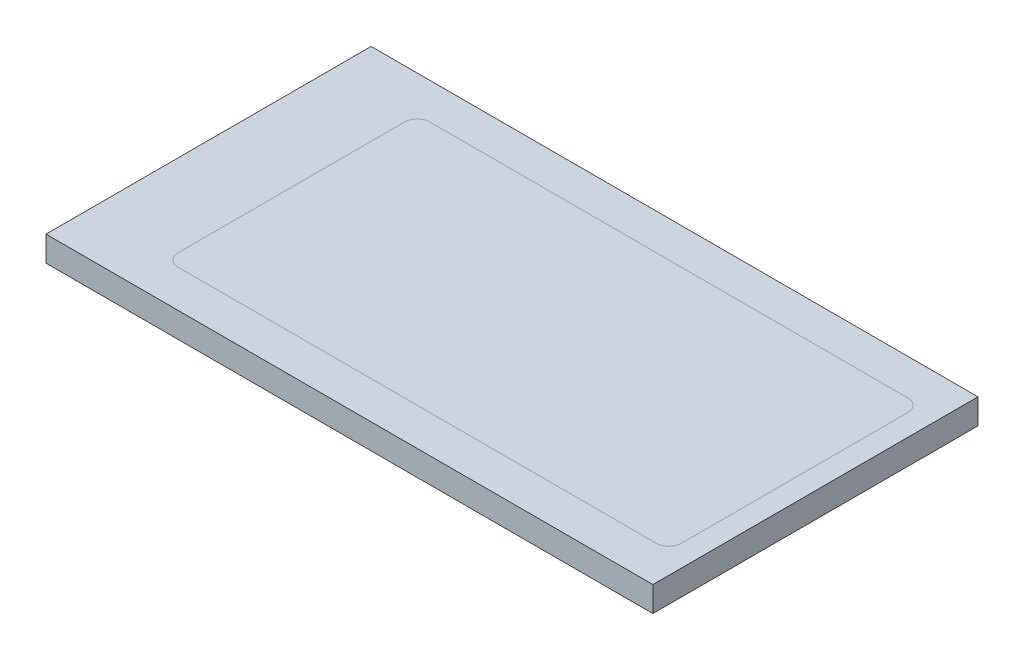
ISO-10303-21;
HEADER;
FILE_DESCRIPTION(('STEP AP214'),'2;1');
FILE_NAME('part.step','',(''),(''),'','','');
FILE_SCHEMA(('AUTOMOTIVE_DESIGN { 1 0 10303 214 1 1 1 1 }'));
ENDSEC;
DATA;
#1=APPLICATION_CONTEXT('core data for automotive mechanical design processes');
#2=APPLICATION_PROTOCOL_DEFINITION('international standard','automotive_design',2000,#1);
#3=PRODUCT_CONTEXT('',#1,'mechanical');
#4=PRODUCT('Part','Part','',(#3));
#5=PRODUCT_RELATED_PRODUCT_CATEGORY('part','',(#4));
#6=PRODUCT_DEFINITION_FORMATION('','',#4);
#7=PRODUCT_DEFINITION_CONTEXT('part definition',#1,'design');
#8=PRODUCT_DEFINITION('design','',#6,#7);
#9=PRODUCT_DEFINITION_SHAPE('','',#8);
#10=(LENGTH_UNIT() NAMED_UNIT(*) SI_UNIT(.MILLI.,.METRE.));
#11=(NAMED_UNIT(*) PLANE_ANGLE_UNIT() SI_UNIT($,.RADIAN.));
#12=(NAMED_UNIT(*) SI_UNIT($,.STERADIAN.) SOLID_ANGLE_UNIT());
#13=UNCERTAINTY_MEASURE_WITH_UNIT(LENGTH_MEASURE(1.E-05),#10,'distance_accuracy_value','');
#14=(GEOMETRIC_REPRESENTATION_CONTEXT(3) GLOBAL_UNCERTAINTY_ASSIGNED_CONTEXT((#13)) GLOBAL_UNIT_ASSIGNED_CONTEXT((#10,
#11,#12)) REPRESENTATION_CONTEXT('',''));
#15=CARTESIAN_POINT('',(0.,0.,0.));
#16=DIRECTION('',(0.,0.,1.));
#17=DIRECTION('',(1.,0.,0.));
#18=AXIS2_PLACEMENT_3D('',#15,#16,#17);
#19=CARTESIAN_POINT('',(0.,-100.,0.));
#20=DIRECTION('',(0.,1.,0.));
#21=DIRECTION('',(0.,0.,1.));
#22=AXIS2_PLACEMENT_3D('',#19,#20,#21);
#23=PLANE('',#22);
#24=DIRECTION('',(0.,0.,-1.));
#25=VECTOR('',#24,1.);
#26=CARTESIAN_POINT('',(577.109459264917,-100.,-513.152738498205));
#27=LINE('',#26,#25);
#28=CARTESIAN_POINT('',(577.109459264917,-100.,-383.952040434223));
#29=VERTEX_POINT('',#28);
#30=CARTESIAN_POINT('',(577.109459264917,-100.,-513.152738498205));
#31=VERTEX_POINT('',#30);
#32=EDGE_CURVE('E123',#29,#31,#27,.T.);
#33=ORIENTED_EDGE('',*,*,#32,.F.);
#34=DIRECTION('',(1.,0.,0.));
#35=VECTOR('',#34,1.);
#36=CARTESIAN_POINT('',(335.935434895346,-100.,-383.952040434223));
#37=LINE('',#36,#35);
#38=CARTESIAN_POINT('',(335.935434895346,-100.,-383.952040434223));
#39=VERTEX_POINT('',#38);
#40=EDGE_CURVE('E136',#39,#29,#37,.T.);
#41=ORIENTED_EDGE('',*,*,#40,.F.);
#42=DIRECTION('',(0.,0.,1.));
#43=VECTOR('',#42,1.);
#44=CARTESIAN_POINT('',(335.935434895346,-100.,-513.152738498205));
#45=LINE('',#44,#43);
#46=CARTESIAN_POINT('',(335.935434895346,-100.,-513.152738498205));
#47=VERTEX_POINT('',#46);
#48=EDGE_CURVE('E125',#47,#39,#45,.T.);
#49=ORIENTED_EDGE('',*,*,#48,.F.);
#50=DIRECTION('',(-1.,0.,0.));
#51=VECTOR('',#50,1.);
#52=CARTESIAN_POINT('',(335.935434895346,-100.,-513.152738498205));
#53=LINE('',#52,#51);
#54=EDGE_CURVE('E114',#31,#47,#53,.T.);
#55=ORIENTED_EDGE('',*,*,#54,.F.);
#56=EDGE_LOOP('',(#33,#41,#49,#55));
#57=FACE_BOUND('',#56,.T.);
#58=ADVANCED_FACE('F40',(#57),#23,.F.);
#59=CARTESIAN_POINT('',(335.935434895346,-50.,-383.952040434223));
#60=DIRECTION('',(0.,0.,-1.));
#61=DIRECTION('',(-1.,0.,0.));
#62=AXIS2_PLACEMENT_3D('',#59,#60,#61);
#63=PLANE('',#62);
#64=DIRECTION('',(0.,-1.,0.));
#65=VECTOR('',#64,1.);
#66=CARTESIAN_POINT('',(577.109459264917,-50.,-383.952040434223));
#67=LINE('',#66,#65);
#68=CARTESIAN_POINT('',(577.109459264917,-90.,-383.952040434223));
#69=VERTEX_POINT('',#68);
#70=EDGE_CURVE('E128',#69,#29,#67,.T.);
#71=ORIENTED_EDGE('',*,*,#70,.F.);
#72=DIRECTION('',(-1.,0.,0.));
#73=VECTOR('',#72,1.);
#74=CARTESIAN_POINT('',(335.935434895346,-90.,-383.952040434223));
#75=LINE('',#74,#73);
#76=CARTESIAN_POINT('',(335.935434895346,-90.,-383.952040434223));
#77=VERTEX_POINT('',#76);
#78=EDGE_CURVE('E44',#69,#77,#75,.T.);
#79=ORIENTED_EDGE('',*,*,#78,.T.);
#80=DIRECTION('',(0.,-1.,0.));
#81=VECTOR('',#80,1.);
#82=CARTESIAN_POINT('',(335.935434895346,-50.,-383.952040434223));
#83=LINE('',#82,#81);
#84=EDGE_CURVE('E139',#77,#39,#83,.T.);
#85=ORIENTED_EDGE('',*,*,#84,.T.);
#86=ORIENTED_EDGE('',*,*,#40,.T.);
#87=EDGE_LOOP('',(#71,#79,#85,#86));
#88=FACE_BOUND('',#87,.T.);
#89=ADVANCED_FACE('F206',(#88),#63,.F.);
#90=CARTESIAN_POINT('',(335.935434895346,-50.,-513.152738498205));
#91=DIRECTION('',(1.,0.,0.));
#92=DIRECTION('',(0.,0.,-1.));
#93=AXIS2_PLACEMENT_3D('',#90,#91,#92);
#94=PLANE('',#93);
#95=ORIENTED_EDGE('',*,*,#84,.F.);
#96=DIRECTION('',(0.,0.,-1.));
#97=VECTOR('',#96,1.);
#98=CARTESIAN_POINT('',(335.935434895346,-90.,-513.152738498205));
#99=LINE('',#98,#97);
#100=CARTESIAN_POINT('',(335.935434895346,-90.,-513.152738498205));
#101=VERTEX_POINT('',#100);
#102=EDGE_CURVE('E145',#77,#101,#99,.T.);
#103=ORIENTED_EDGE('',*,*,#102,.T.);
#104=DIRECTION('',(0.,-1.,0.));
#105=VECTOR('',#104,1.);
#106=CARTESIAN_POINT('',(335.935434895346,-50.,-513.152738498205));
#107=LINE('',#106,#105);
#108=EDGE_CURVE('E119',#101,#47,#107,.T.);
#109=ORIENTED_EDGE('',*,*,#108,.T.);
#110=ORIENTED_EDGE('',*,*,#48,.T.);
#111=EDGE_LOOP('',(#95,#103,#109,#110));
#112=FACE_BOUND('',#111,.T.);
#113=ADVANCED_FACE('F144',(#112),#94,.F.);
#114=CARTESIAN_POINT('',(335.935434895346,-50.,-513.152738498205));
#115=DIRECTION('',(0.,0.,1.));
#116=DIRECTION('',(1.,0.,0.));
#117=AXIS2_PLACEMENT_3D('',#114,#115,#116);
#118=PLANE('',#117);
#119=ORIENTED_EDGE('',*,*,#108,.F.);
#120=DIRECTION('',(1.,0.,0.));
#121=VECTOR('',#120,1.);
#122=CARTESIAN_POINT('',(335.935434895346,-90.,-513.152738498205));
#123=LINE('',#122,#121);
#124=CARTESIAN_POINT('',(577.109459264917,-90.,-513.152738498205));
#125=VERTEX_POINT('',#124);
#126=EDGE_CURVE('E60',#101,#125,#123,.T.);
#127=ORIENTED_EDGE('',*,*,#126,.T.);
#128=DIRECTION('',(0.,-1.,0.));
#129=VECTOR('',#128,1.);
#130=CARTESIAN_POINT('',(577.109459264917,-50.,-513.152738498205));
#131=LINE('',#130,#129);
#132=EDGE_CURVE('E111',#125,#31,#131,.T.);
#133=ORIENTED_EDGE('',*,*,#132,.T.);
#134=ORIENTED_EDGE('',*,*,#54,.T.);
#135=EDGE_LOOP('',(#119,#127,#133,#134));
#136=FACE_BOUND('',#135,.T.);
#137=ADVANCED_FACE('F113',(#136),#118,.F.);
#138=CARTESIAN_POINT('',(577.109459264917,-50.,-513.152738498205));
#139=DIRECTION('',(-1.,0.,0.));
#140=DIRECTION('',(0.,0.,1.));
#141=AXIS2_PLACEMENT_3D('',#138,#139,#140);
#142=PLANE('',#141);
#143=ORIENTED_EDGE('',*,*,#132,.F.);
#144=DIRECTION('',(0.,0.,1.));
#145=VECTOR('',#144,1.);
#146=CARTESIAN_POINT('',(577.109459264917,-90.,-513.152738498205));
#147=LINE('',#146,#145);
#148=EDGE_CURVE('E132',#125,#69,#147,.T.);
#149=ORIENTED_EDGE('',*,*,#148,.T.);
#150=ORIENTED_EDGE('',*,*,#70,.T.);
#151=ORIENTED_EDGE('',*,*,#32,.T.);
#152=EDGE_LOOP('',(#143,#149,#150,#151));
#153=FACE_BOUND('',#152,.T.);
#154=ADVANCED_FACE('F42',(#153),#142,.F.);
#155=CARTESIAN_POINT('',(373.58203197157,-90.,-398.813583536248));
#156=DIRECTION('',(0.,-1.,0.));
#157=DIRECTION('',(1.,0.,0.));
#158=AXIS2_PLACEMENT_3D('',#155,#156,#157);
#159=PLANE('',#158);
#160=DIRECTION('',(-1.,0.,0.));
#161=VECTOR('',#160,1.);
#162=CARTESIAN_POINT('',(563.582222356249,-90.,-498.813583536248));
#163=LINE('',#162,#161);
#164=CARTESIAN_POINT('',(563.582222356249,-90.,-498.813583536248));
#165=VERTEX_POINT('',#164);
#166=CARTESIAN_POINT('',(373.58203197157,-90.,-498.813583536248));
#167=VERTEX_POINT('',#166);
#168=EDGE_CURVE('E199',#165,#167,#163,.T.);
#169=ORIENTED_EDGE('',*,*,#168,.F.);
#170=CARTESIAN_POINT('',(568.58203197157,-90.,-493.813773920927));
#171=CARTESIAN_POINT('',(568.582031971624,-90.,-494.303840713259));
#172=CARTESIAN_POINT('',(568.485900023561,-90.,-494.787990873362));
#173=CARTESIAN_POINT('',(568.389645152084,-90.,-495.272760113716));
#174=CARTESIAN_POINT('',(568.201313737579,-90.,-495.72747973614));
#175=CARTESIAN_POINT('',(568.014381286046,-90.,-496.178821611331));
#176=CARTESIAN_POINT('',(567.74099144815,-90.,-496.588649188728));
#177=CARTESIAN_POINT('',(567.466590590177,-90.,-496.999992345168));
#178=CARTESIAN_POINT('',(567.118583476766,-90.,-497.348257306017));
#179=CARTESIAN_POINT('',(566.773102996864,-90.,-497.693993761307));
#180=CARTESIAN_POINT('',(566.36353488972,-90.,-497.968240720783));
#181=CARTESIAN_POINT('',(565.953400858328,-90.,-498.24286662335));
#182=CARTESIAN_POINT('',(565.499456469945,-90.,-498.431401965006));
#183=CARTESIAN_POINT('',(565.046571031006,-90.,-498.619497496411));
#184=CARTESIAN_POINT('',(564.561628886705,-90.,-498.716417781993));
#185=CARTESIAN_POINT('',(564.075458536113,-90.,-498.813583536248));
#186=CARTESIAN_POINT('',(563.582222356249,-90.,-498.813583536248));
#187=B_SPLINE_CURVE_WITH_KNOTS('',2,(#170,#171,#172,#173,#174,#175,#176,#177,#178,#179,#180,
#181,#182,#183,#184,#185,#186),.UNSPECIFIED.,.F.,.F.,(3,2,2,2,2,2,2,2,3),(0.,0.125,0.25,0.375,
0.5,0.625,0.75,0.875,1.),.UNSPECIFIED.);
#188=CARTESIAN_POINT('',(568.58203197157,-90.,-493.813773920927));
#189=VERTEX_POINT('',#188);
#190=EDGE_CURVE('E11',#189,#165,#187,.T.);
#191=ORIENTED_EDGE('',*,*,#190,.F.);
#192=DIRECTION('',(0.,0.,-1.));
#193=VECTOR('',#192,1.);
#194=CARTESIAN_POINT('',(568.58203197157,-90.,-403.813393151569));
#195=LINE('',#194,#193);
#196=CARTESIAN_POINT('',(568.58203197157,-90.,-403.813393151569));
#197=VERTEX_POINT('',#196);
#198=EDGE_CURVE('E51',#197,#189,#195,.T.);
#199=ORIENTED_EDGE('',*,*,#198,.F.);
#200=CARTESIAN_POINT('',(563.582222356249,-90.,-398.813583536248));
#201=CARTESIAN_POINT('',(564.072289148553,-90.,-398.813583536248));
#202=CARTESIAN_POINT('',(564.556439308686,-90.,-398.909715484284));
#203=CARTESIAN_POINT('',(565.04120854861,-90.,-399.005970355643));
#204=CARTESIAN_POINT('',(565.495928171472,-90.,-399.194301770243));
#205=CARTESIAN_POINT('',(565.947270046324,-90.,-399.381234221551));
#206=CARTESIAN_POINT('',(566.357097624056,-90.,-399.65462405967));
#207=CARTESIAN_POINT('',(566.768440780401,-90.,-399.929024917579));
#208=CARTESIAN_POINT('',(567.116705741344,-90.,-400.277032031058));
#209=CARTESIAN_POINT('',(567.462442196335,-90.,-400.622512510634));
#210=CARTESIAN_POINT('',(567.73668915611,-90.,-401.032080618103));
#211=CARTESIAN_POINT('',(568.011315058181,-90.,-401.442214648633));
#212=CARTESIAN_POINT('',(568.199850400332,-90.,-401.896159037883));
#213=CARTESIAN_POINT('',(568.387945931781,-90.,-402.349044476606));
#214=CARTESIAN_POINT('',(568.484866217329,-90.,-402.833986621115));
#215=CARTESIAN_POINT('',(568.582031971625,-90.,-403.320156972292));
#216=CARTESIAN_POINT('',(568.58203197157,-90.,-403.813393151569));
#217=B_SPLINE_CURVE_WITH_KNOTS('',2,(#200,#201,#202,#203,#204,#205,#206,#207,#208,#209,#210,
#211,#212,#213,#214,#215,#216),.UNSPECIFIED.,.F.,.F.,(3,2,2,2,2,2,2,2,3),(0.,0.125,0.25,0.375,
0.5,0.625,0.75,0.875,1.),.UNSPECIFIED.);
#218=CARTESIAN_POINT('',(563.582222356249,-90.,-398.813583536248));
#219=VERTEX_POINT('',#218);
#220=EDGE_CURVE('E175',#219,#197,#217,.T.);
#221=ORIENTED_EDGE('',*,*,#220,.F.);
#222=DIRECTION('',(1.,0.,0.));
#223=VECTOR('',#222,1.);
#224=CARTESIAN_POINT('',(373.58203197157,-90.,-398.813583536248));
#225=LINE('',#224,#223);
#226=CARTESIAN_POINT('',(373.58203197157,-90.,-398.813583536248));
#227=VERTEX_POINT('',#226);
#228=EDGE_CURVE('E178',#227,#219,#225,.T.);
#229=ORIENTED_EDGE('',*,*,#228,.F.);
#230=CARTESIAN_POINT('',(368.58203197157,-90.,-403.813773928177));
#231=CARTESIAN_POINT('',(368.582031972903,-90.,-403.323684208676));
#232=CARTESIAN_POINT('',(368.678169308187,-90.,-402.83950449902));
#233=CARTESIAN_POINT('',(368.774428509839,-90.,-402.354711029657));
#234=CARTESIAN_POINT('',(368.962766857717,-90.,-401.899963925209));
#235=CARTESIAN_POINT('',(369.149705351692,-90.,-401.448596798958));
#236=CARTESIAN_POINT('',(369.423102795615,-90.,-401.038741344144));
#237=CARTESIAN_POINT('',(369.697511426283,-90.,-400.627369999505));
#238=CARTESIAN_POINT('',(370.045526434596,-90.,-400.279077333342));
#239=CARTESIAN_POINT('',(370.391016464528,-90.,-399.933311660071));
#240=CARTESIAN_POINT('',(370.800594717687,-90.,-399.659037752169));
#241=CARTESIAN_POINT('',(371.210745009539,-90.,-399.384380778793));
#242=CARTESIAN_POINT('',(371.664704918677,-90.,-399.195821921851));
#243=CARTESIAN_POINT('',(372.117610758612,-90.,-399.007700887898));
#244=CARTESIAN_POINT('',(372.602571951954,-90.,-398.91076602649));
#245=CARTESIAN_POINT('',(373.088772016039,-90.,-398.813583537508));
#246=CARTESIAN_POINT('',(373.58203197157,-90.,-398.813583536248));
#247=B_SPLINE_CURVE_WITH_KNOTS('',2,(#230,#231,#232,#233,#234,#235,#236,#237,#238,#239,#240,
#241,#242,#243,#244,#245,#246),.UNSPECIFIED.,.F.,.F.,(3,2,2,2,2,2,2,2,3),(0.,0.125,0.25,0.375,
0.5,0.625,0.75,0.875,1.),.UNSPECIFIED.);
#248=CARTESIAN_POINT('',(368.58203197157,-90.,-403.813773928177));
#249=VERTEX_POINT('',#248);
#250=EDGE_CURVE('E86',#249,#227,#247,.T.);
#251=ORIENTED_EDGE('',*,*,#250,.F.);
#252=DIRECTION('',(0.,0.,1.));
#253=VECTOR('',#252,1.);
#254=CARTESIAN_POINT('',(368.58203197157,-90.,-493.81339314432));
#255=LINE('',#254,#253);
#256=CARTESIAN_POINT('',(368.58203197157,-90.,-493.81339314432));
#257=VERTEX_POINT('',#256);
#258=EDGE_CURVE('E82',#257,#249,#255,.T.);
#259=ORIENTED_EDGE('',*,*,#258,.F.);
#260=CARTESIAN_POINT('',(373.58203197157,-90.,-498.813583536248));
#261=CARTESIAN_POINT('',(373.091942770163,-90.,-498.81358353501));
#262=CARTESIAN_POINT('',(372.607764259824,-90.,-498.71743550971));
#263=CARTESIAN_POINT('',(372.122974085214,-90.,-498.621166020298));
#264=CARTESIAN_POINT('',(371.668232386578,-90.,-498.432808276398));
#265=CARTESIAN_POINT('',(371.216875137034,-90.,-498.245852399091));
#266=CARTESIAN_POINT('',(370.807031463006,-90.,-497.972431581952));
#267=CARTESIAN_POINT('',(370.395677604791,-90.,-497.698003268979));
#268=CARTESIAN_POINT('',(370.047402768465,-90.,-497.349966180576));
#269=CARTESIAN_POINT('',(369.701657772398,-90.,-497.004457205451));
#270=CARTESIAN_POINT('',(369.427402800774,-90.,-496.594859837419));
#271=CARTESIAN_POINT('',(369.152770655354,-90.,-496.184699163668));
#272=CARTESIAN_POINT('',(368.964230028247,-90.,-495.730731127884));
#273=CARTESIAN_POINT('',(368.776127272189,-90.,-495.277817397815));
#274=CARTESIAN_POINT('',(368.679202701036,-90.,-494.792850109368));
#275=CARTESIAN_POINT('',(368.582031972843,-90.,-494.30665116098));
#276=CARTESIAN_POINT('',(368.58203197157,-90.,-493.81339314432));
#277=B_SPLINE_CURVE_WITH_KNOTS('',2,(#260,#261,#262,#263,#264,#265,#266,#267,#268,#269,#270,
#271,#272,#273,#274,#275,#276),.UNSPECIFIED.,.F.,.F.,(3,2,2,2,2,2,2,2,3),(0.,0.125,0.25,0.375,
0.5,0.625,0.75,0.875,1.),.UNSPECIFIED.);
#278=EDGE_CURVE('E78',#167,#257,#277,.T.);
#279=ORIENTED_EDGE('',*,*,#278,.F.);
#280=EDGE_LOOP('',(#169,#191,#199,#221,#229,#251,#259,#279));
#281=FACE_BOUND('',#280,.T.);
#282=ORIENTED_EDGE('',*,*,#126,.F.);
#283=ORIENTED_EDGE('',*,*,#102,.F.);
#284=ORIENTED_EDGE('',*,*,#78,.F.);
#285=ORIENTED_EDGE('',*,*,#148,.F.);
#286=EDGE_LOOP('',(#282,#283,#284,#285));
#287=FACE_BOUND('',#286,.T.);
#288=ADVANCED_FACE('F152',(#281,#287),#159,.F.);
#289=CARTESIAN_POINT('',(563.581841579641,-90.,-493.81339314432));
#290=DIRECTION('',(0.,1.,0.));
#291=DIRECTION('',(0.,0.,1.));
#292=AXIS2_PLACEMENT_3D('',#289,#290,#291);
#293=PLANE('',#292);
#294=ORIENTED_EDGE('',*,*,#190,.T.);
#295=ORIENTED_EDGE('',*,*,#168,.T.);
#296=ORIENTED_EDGE('',*,*,#278,.T.);
#297=ORIENTED_EDGE('',*,*,#258,.T.);
#298=ORIENTED_EDGE('',*,*,#250,.T.);
#299=ORIENTED_EDGE('',*,*,#228,.T.);
#300=ORIENTED_EDGE('',*,*,#220,.T.);
#301=ORIENTED_EDGE('',*,*,#198,.T.);
#302=EDGE_LOOP('',(#294,#295,#296,#297,#298,#299,#300,#301));
#303=FACE_BOUND('',#302,.T.);
#304=ADVANCED_FACE('F162',(#303),#293,.T.);
#305=CLOSED_SHELL('',(#58,#89,#113,#137,#154,#288,#304));
#306=MANIFOLD_SOLID_BREP('B2',#305);
#307=ADVANCED_BREP_SHAPE_REPRESENTATION('',(#18,#306),#14);
#308=SHAPE_DEFINITION_REPRESENTATION(#9,#307);
ENDSEC;
END-ISO-10303-21;
